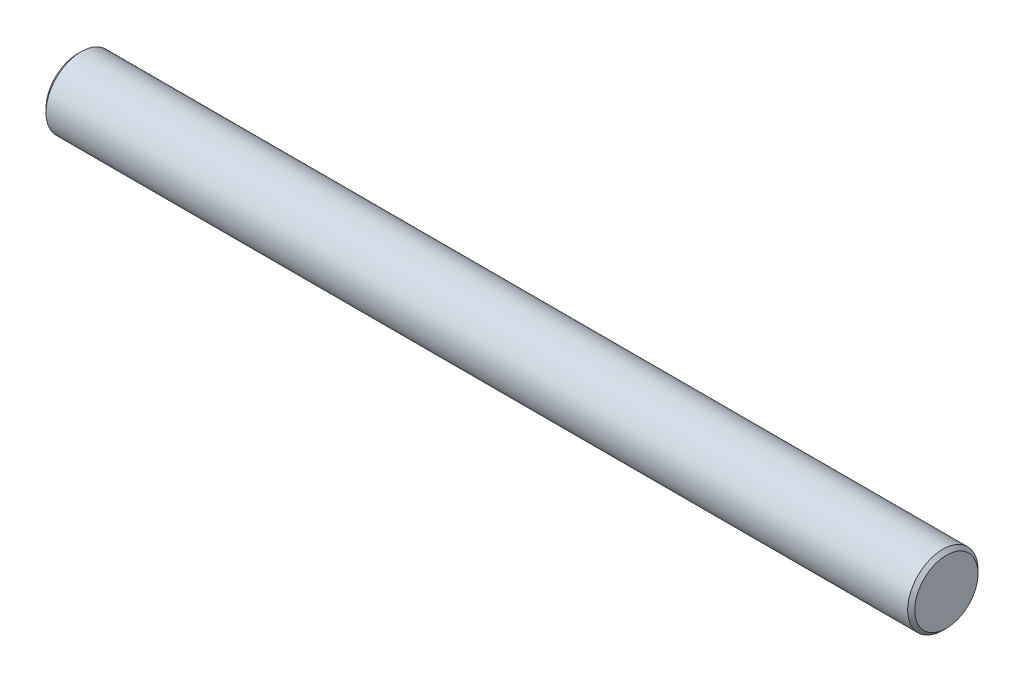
ISO-10303-21;
HEADER;
FILE_DESCRIPTION(('STEP AP214'),'2;1');
FILE_NAME('part.step','',(''),(''),'','','');
FILE_SCHEMA(('AUTOMOTIVE_DESIGN { 1 0 10303 214 1 1 1 1 }'));
ENDSEC;
DATA;
#1=APPLICATION_CONTEXT('core data for automotive mechanical design processes');
#2=APPLICATION_PROTOCOL_DEFINITION('international standard','automotive_design',2000,#1);
#3=PRODUCT_CONTEXT('',#1,'mechanical');
#4=PRODUCT('Part','Part','',(#3));
#5=PRODUCT_RELATED_PRODUCT_CATEGORY('part','',(#4));
#6=PRODUCT_DEFINITION_FORMATION('','',#4);
#7=PRODUCT_DEFINITION_CONTEXT('part definition',#1,'design');
#8=PRODUCT_DEFINITION('design','',#6,#7);
#9=PRODUCT_DEFINITION_SHAPE('','',#8);
#10=(LENGTH_UNIT() NAMED_UNIT(*) SI_UNIT(.MILLI.,.METRE.));
#11=(NAMED_UNIT(*) PLANE_ANGLE_UNIT() SI_UNIT($,.RADIAN.));
#12=(NAMED_UNIT(*) SI_UNIT($,.STERADIAN.) SOLID_ANGLE_UNIT());
#13=UNCERTAINTY_MEASURE_WITH_UNIT(LENGTH_MEASURE(1.E-05),#10,'distance_accuracy_value','');
#14=(GEOMETRIC_REPRESENTATION_CONTEXT(3) GLOBAL_UNCERTAINTY_ASSIGNED_CONTEXT((#13)) GLOBAL_UNIT_ASSIGNED_CONTEXT((#10,
#11,#12)) REPRESENTATION_CONTEXT('',''));
#15=CARTESIAN_POINT('',(0.,0.,0.));
#16=DIRECTION('',(0.,0.,1.));
#17=DIRECTION('',(1.,0.,0.));
#18=AXIS2_PLACEMENT_3D('',#15,#16,#17);
#19=CARTESIAN_POINT('',(247.,0.,0.));
#20=DIRECTION('',(-1.,0.,0.));
#21=DIRECTION('',(0.,0.,1.));
#22=AXIS2_PLACEMENT_3D('',#19,#20,#21);
#23=CYLINDRICAL_SURFACE('',#22,10.);
#24=CARTESIAN_POINT('',(246.,0.,0.));
#25=DIRECTION('',(1.,0.,0.));
#26=DIRECTION('',(0.,0.,-1.));
#27=AXIS2_PLACEMENT_3D('',#24,#25,#26);
#28=CIRCLE('',#27,10.);
#29=CARTESIAN_POINT('',(246.,0.,-10.));
#30=VERTEX_POINT('',#29);
#31=EDGE_CURVE('E9178',#30,#30,#28,.F.);
#32=ORIENTED_EDGE('',*,*,#31,.T.);
#33=EDGE_LOOP('',(#32));
#34=FACE_BOUND('',#33,.T.);
#35=CARTESIAN_POINT('',(1.,0.,0.));
#36=DIRECTION('',(1.,0.,0.));
#37=DIRECTION('',(0.,0.,-1.));
#38=AXIS2_PLACEMENT_3D('',#35,#36,#37);
#39=CIRCLE('',#38,10.);
#40=CARTESIAN_POINT('',(1.,0.,-10.));
#41=VERTEX_POINT('',#40);
#42=EDGE_CURVE('E9182',#41,#41,#39,.T.);
#43=ORIENTED_EDGE('',*,*,#42,.T.);
#44=EDGE_LOOP('',(#43));
#45=FACE_BOUND('',#44,.T.);
#46=ADVANCED_FACE('F9172',(#34,#45),#23,.T.);
#47=CARTESIAN_POINT('',(247.,0.,0.));
#48=DIRECTION('',(1.,0.,0.));
#49=DIRECTION('',(0.,0.,-1.));
#50=AXIS2_PLACEMENT_3D('',#47,#48,#49);
#51=PLANE('',#50);
#52=CARTESIAN_POINT('',(247.,0.,0.));
#53=DIRECTION('',(1.,0.,0.));
#54=DIRECTION('',(0.,0.,-1.));
#55=AXIS2_PLACEMENT_3D('',#52,#53,#54);
#56=CIRCLE('',#55,9.);
#57=CARTESIAN_POINT('',(247.,0.,-9.));
#58=VERTEX_POINT('',#57);
#59=EDGE_CURVE('E9186',#58,#58,#56,.T.);
#60=ORIENTED_EDGE('',*,*,#59,.T.);
#61=EDGE_LOOP('',(#60));
#62=FACE_BOUND('',#61,.T.);
#63=ADVANCED_FACE('F9192',(#62),#51,.T.);
#64=CARTESIAN_POINT('',(0.,0.,0.));
#65=DIRECTION('',(1.,0.,0.));
#66=DIRECTION('',(0.,0.,-1.));
#67=AXIS2_PLACEMENT_3D('',#64,#65,#66);
#68=PLANE('',#67);
#69=CARTESIAN_POINT('',(0.,0.,0.));
#70=DIRECTION('',(1.,0.,0.));
#71=DIRECTION('',(0.,0.,-1.));
#72=AXIS2_PLACEMENT_3D('',#69,#70,#71);
#73=CIRCLE('',#72,8.99999999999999);
#74=CARTESIAN_POINT('',(0.,0.,-8.99999999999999));
#75=VERTEX_POINT('',#74);
#76=EDGE_CURVE('E10',#75,#75,#73,.F.);
#77=ORIENTED_EDGE('',*,*,#76,.T.);
#78=EDGE_LOOP('',(#77));
#79=FACE_BOUND('',#78,.T.);
#80=ADVANCED_FACE('F9197',(#79),#68,.F.);
#81=CARTESIAN_POINT('',(247.,0.,0.));
#82=DIRECTION('',(-1.,0.,0.));
#83=DIRECTION('',(0.,0.,1.));
#84=AXIS2_PLACEMENT_3D('',#81,#82,#83);
#85=CONICAL_SURFACE('',#84,9.,0.785398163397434);
#86=ORIENTED_EDGE('',*,*,#31,.F.);
#87=EDGE_LOOP('',(#86));
#88=FACE_BOUND('',#87,.T.);
#89=ORIENTED_EDGE('',*,*,#59,.F.);
#90=EDGE_LOOP('',(#89));
#91=FACE_BOUND('',#90,.T.);
#92=ADVANCED_FACE('F9194',(#88,#91),#85,.T.);
#93=CARTESIAN_POINT('',(1.,0.,0.));
#94=DIRECTION('',(1.,0.,0.));
#95=DIRECTION('',(0.,0.,-1.));
#96=AXIS2_PLACEMENT_3D('',#93,#94,#95);
#97=CONICAL_SURFACE('',#96,10.,0.785398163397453);
#98=ORIENTED_EDGE('',*,*,#76,.F.);
#99=EDGE_LOOP('',(#98));
#100=FACE_BOUND('',#99,.T.);
#101=ORIENTED_EDGE('',*,*,#42,.F.);
#102=EDGE_LOOP('',(#101));
#103=FACE_BOUND('',#102,.T.);
#104=ADVANCED_FACE('F9196',(#100,#103),#97,.T.);
#105=CLOSED_SHELL('',(#46,#63,#80,#92,#104));
#106=MANIFOLD_SOLID_BREP('B2',#105);
#107=ADVANCED_BREP_SHAPE_REPRESENTATION('',(#18,#106),#14);
#108=SHAPE_DEFINITION_REPRESENTATION(#9,#107);
ENDSEC;
END-ISO-10303-21;
